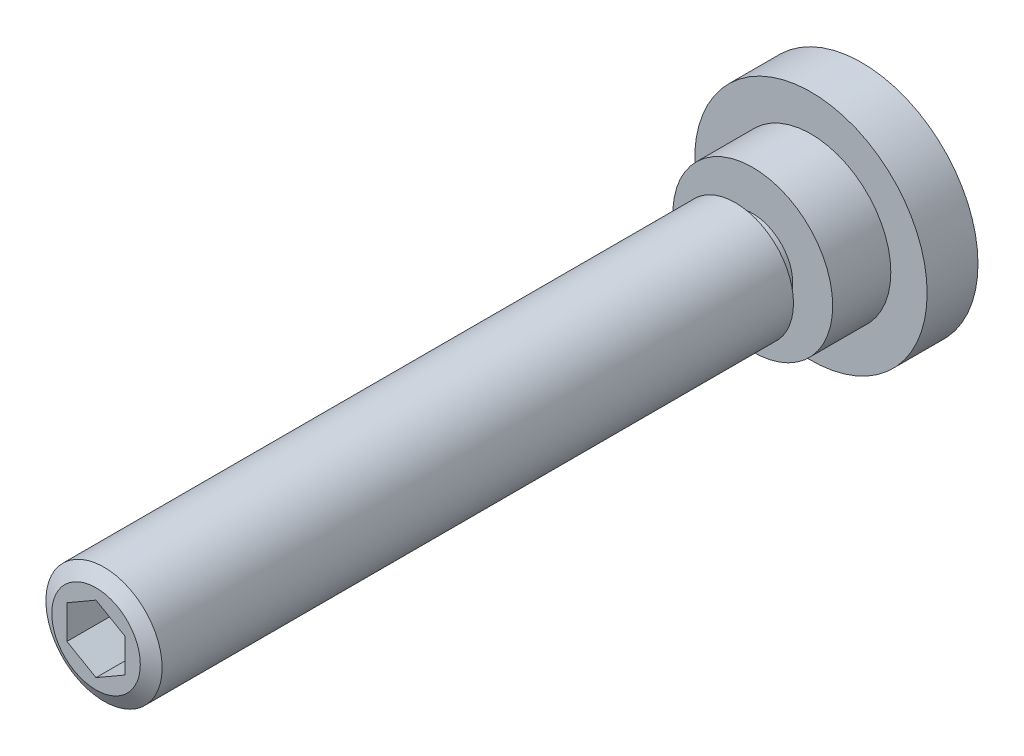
ISO-10303-21;
HEADER;
FILE_DESCRIPTION(('STEP AP214'),'2;1');
FILE_NAME('part.step','',(''),(''),'','','');
FILE_SCHEMA(('AUTOMOTIVE_DESIGN { 1 0 10303 214 1 1 1 1 }'));
ENDSEC;
DATA;
#1=APPLICATION_CONTEXT('core data for automotive mechanical design processes');
#2=APPLICATION_PROTOCOL_DEFINITION('international standard','automotive_design',2000,#1);
#3=PRODUCT_CONTEXT('',#1,'mechanical');
#4=PRODUCT('Part','Part','',(#3));
#5=PRODUCT_RELATED_PRODUCT_CATEGORY('part','',(#4));
#6=PRODUCT_DEFINITION_FORMATION('','',#4);
#7=PRODUCT_DEFINITION_CONTEXT('part definition',#1,'design');
#8=PRODUCT_DEFINITION('design','',#6,#7);
#9=PRODUCT_DEFINITION_SHAPE('','',#8);
#10=(LENGTH_UNIT() NAMED_UNIT(*) SI_UNIT(.MILLI.,.METRE.));
#11=(NAMED_UNIT(*) PLANE_ANGLE_UNIT() SI_UNIT($,.RADIAN.));
#12=(NAMED_UNIT(*) SI_UNIT($,.STERADIAN.) SOLID_ANGLE_UNIT());
#13=UNCERTAINTY_MEASURE_WITH_UNIT(LENGTH_MEASURE(1.E-05),#10,'distance_accuracy_value','');
#14=(GEOMETRIC_REPRESENTATION_CONTEXT(3) GLOBAL_UNCERTAINTY_ASSIGNED_CONTEXT((#13)) GLOBAL_UNIT_ASSIGNED_CONTEXT((#10,
#11,#12)) REPRESENTATION_CONTEXT('',''));
#15=CARTESIAN_POINT('',(0.,0.,0.));
#16=DIRECTION('',(0.,0.,1.));
#17=DIRECTION('',(1.,0.,0.));
#18=AXIS2_PLACEMENT_3D('',#15,#16,#17);
#19=CARTESIAN_POINT('',(-8.,0.,15.));
#20=DIRECTION('',(0.,0.,1.));
#21=DIRECTION('',(1.,0.,0.));
#22=AXIS2_PLACEMENT_3D('',#19,#20,#21);
#23=PLANE('',#22);
#24=CARTESIAN_POINT('',(0.,0.,15.));
#25=DIRECTION('',(0.,0.,1.));
#26=DIRECTION('',(1.,0.,0.));
#27=AXIS2_PLACEMENT_3D('',#24,#25,#26);
#28=CIRCLE('',#27,11.);
#29=CARTESIAN_POINT('',(11.,0.,15.));
#30=VERTEX_POINT('',#29);
#31=EDGE_CURVE('E131',#30,#30,#28,.T.);
#32=ORIENTED_EDGE('',*,*,#31,.T.);
#33=EDGE_LOOP('',(#32));
#34=FACE_BOUND('',#33,.T.);
#35=CARTESIAN_POINT('',(0.,0.,15.));
#36=DIRECTION('',(0.,0.,-1.));
#37=DIRECTION('',(-1.,0.,0.));
#38=AXIS2_PLACEMENT_3D('',#35,#36,#37);
#39=CIRCLE('',#38,5.5);
#40=CARTESIAN_POINT('',(-5.5,0.,15.));
#41=VERTEX_POINT('',#40);
#42=EDGE_CURVE('E314',#41,#41,#39,.T.);
#43=ORIENTED_EDGE('',*,*,#42,.T.);
#44=EDGE_LOOP('',(#43));
#45=FACE_BOUND('',#44,.T.);
#46=ADVANCED_FACE('F14',(#34,#45),#23,.T.);
#47=CARTESIAN_POINT('',(0.,0.,30.));
#48=DIRECTION('',(0.,0.,1.));
#49=DIRECTION('',(1.,0.,0.));
#50=AXIS2_PLACEMENT_3D('',#47,#48,#49);
#51=CYLINDRICAL_SURFACE('',#50,11.);
#52=CARTESIAN_POINT('',(0.,0.,7.));
#53=DIRECTION('',(0.,0.,1.));
#54=DIRECTION('',(1.,0.,0.));
#55=AXIS2_PLACEMENT_3D('',#52,#53,#54);
#56=CIRCLE('',#55,11.);
#57=CARTESIAN_POINT('',(11.,0.,7.));
#58=VERTEX_POINT('',#57);
#59=EDGE_CURVE('E128',#58,#58,#56,.T.);
#60=ORIENTED_EDGE('',*,*,#59,.T.);
#61=EDGE_LOOP('',(#60));
#62=FACE_BOUND('',#61,.T.);
#63=ORIENTED_EDGE('',*,*,#31,.F.);
#64=EDGE_LOOP('',(#63));
#65=FACE_BOUND('',#64,.T.);
#66=ADVANCED_FACE('F149',(#62,#65),#51,.T.);
#67=CARTESIAN_POINT('',(-11.,0.,7.));
#68=DIRECTION('',(0.,0.,1.));
#69=DIRECTION('',(1.,0.,0.));
#70=AXIS2_PLACEMENT_3D('',#67,#68,#69);
#71=PLANE('',#70);
#72=CARTESIAN_POINT('',(0.,0.,7.));
#73=DIRECTION('',(0.,0.,1.));
#74=DIRECTION('',(1.,0.,0.));
#75=AXIS2_PLACEMENT_3D('',#72,#73,#74);
#76=CIRCLE('',#75,16.);
#77=CARTESIAN_POINT('',(16.,0.,7.));
#78=VERTEX_POINT('',#77);
#79=EDGE_CURVE('E125',#78,#78,#76,.T.);
#80=ORIENTED_EDGE('',*,*,#79,.T.);
#81=EDGE_LOOP('',(#80));
#82=FACE_BOUND('',#81,.T.);
#83=ORIENTED_EDGE('',*,*,#59,.F.);
#84=EDGE_LOOP('',(#83));
#85=FACE_BOUND('',#84,.T.);
#86=ADVANCED_FACE('F156',(#82,#85),#71,.T.);
#87=CARTESIAN_POINT('',(0.,0.,30.));
#88=DIRECTION('',(0.,0.,1.));
#89=DIRECTION('',(1.,0.,0.));
#90=AXIS2_PLACEMENT_3D('',#87,#88,#89);
#91=CYLINDRICAL_SURFACE('',#90,16.);
#92=CARTESIAN_POINT('',(0.,0.,0.));
#93=DIRECTION('',(0.,0.,1.));
#94=DIRECTION('',(1.,0.,0.));
#95=AXIS2_PLACEMENT_3D('',#92,#93,#94);
#96=CIRCLE('',#95,16.);
#97=CARTESIAN_POINT('',(16.,0.,0.));
#98=VERTEX_POINT('',#97);
#99=EDGE_CURVE('E116',#98,#98,#96,.T.);
#100=ORIENTED_EDGE('',*,*,#99,.T.);
#101=EDGE_LOOP('',(#100));
#102=FACE_BOUND('',#101,.T.);
#103=ORIENTED_EDGE('',*,*,#79,.F.);
#104=EDGE_LOOP('',(#103));
#105=FACE_BOUND('',#104,.T.);
#106=ADVANCED_FACE('F182',(#102,#105),#91,.T.);
#107=CARTESIAN_POINT('',(-16.,0.,0.));
#108=DIRECTION('',(0.,0.,-1.));
#109=DIRECTION('',(-1.,0.,0.));
#110=AXIS2_PLACEMENT_3D('',#107,#108,#109);
#111=PLANE('',#110);
#112=ORIENTED_EDGE('',*,*,#99,.F.);
#113=EDGE_LOOP('',(#112));
#114=FACE_BOUND('',#113,.T.);
#115=ADVANCED_FACE('F178',(#114),#111,.T.);
#116=CARTESIAN_POINT('',(0.,0.,0.));
#117=DIRECTION('',(0.,0.,-1.));
#118=DIRECTION('',(-1.,0.,0.));
#119=AXIS2_PLACEMENT_3D('',#116,#117,#118);
#120=CYLINDRICAL_SURFACE('',#119,5.5);
#121=ORIENTED_EDGE('',*,*,#42,.F.);
#122=EDGE_LOOP('',(#121));
#123=FACE_BOUND('',#122,.T.);
#124=CARTESIAN_POINT('',(0.,0.,15.956624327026));
#125=DIRECTION('',(0.,0.,-1.));
#126=DIRECTION('',(-1.,0.,0.));
#127=AXIS2_PLACEMENT_3D('',#124,#125,#126);
#128=CIRCLE('',#127,5.5);
#129=CARTESIAN_POINT('',(-5.5,0.,15.956624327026));
#130=VERTEX_POINT('',#129);
#131=EDGE_CURVE('E316',#130,#130,#128,.T.);
#132=ORIENTED_EDGE('',*,*,#131,.T.);
#133=EDGE_LOOP('',(#132));
#134=FACE_BOUND('',#133,.T.);
#135=ADVANCED_FACE('F181',(#123,#134),#120,.T.);
#136=CARTESIAN_POINT('',(0.,0.,17.4));
#137=DIRECTION('',(0.,0.,1.));
#138=DIRECTION('',(1.,0.,0.));
#139=AXIS2_PLACEMENT_3D('',#136,#137,#138);
#140=CONICAL_SURFACE('',#139,8.,1.0471975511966);
#141=ORIENTED_EDGE('',*,*,#131,.F.);
#142=EDGE_LOOP('',(#141));
#143=FACE_BOUND('',#142,.T.);
#144=CARTESIAN_POINT('',(0.,0.,17.4));
#145=DIRECTION('',(0.,0.,-1.));
#146=DIRECTION('',(-1.,0.,0.));
#147=AXIS2_PLACEMENT_3D('',#144,#145,#146);
#148=CIRCLE('',#147,8.);
#149=CARTESIAN_POINT('',(-8.,0.,17.4));
#150=VERTEX_POINT('',#149);
#151=EDGE_CURVE('E321',#150,#150,#148,.T.);
#152=ORIENTED_EDGE('',*,*,#151,.T.);
#153=EDGE_LOOP('',(#152));
#154=FACE_BOUND('',#153,.T.);
#155=ADVANCED_FACE('F221',(#143,#154),#140,.T.);
#156=CARTESIAN_POINT('',(4.,2.30940107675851,99.4));
#157=DIRECTION('',(0.,0.,-1.));
#158=DIRECTION('',(-1.,0.,0.));
#159=AXIS2_PLACEMENT_3D('',#156,#157,#158);
#160=PLANE('',#159);
#161=DIRECTION('',(-0.866025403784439,0.5,0.));
#162=VECTOR('',#161,1.);
#163=CARTESIAN_POINT('',(4.,2.30940107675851,99.4));
#164=LINE('',#163,#162);
#165=CARTESIAN_POINT('',(4.,2.30940107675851,99.4));
#166=VERTEX_POINT('',#165);
#167=CARTESIAN_POINT('',(0.,4.618802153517,99.4));
#168=VERTEX_POINT('',#167);
#169=EDGE_CURVE('E100',#166,#168,#164,.T.);
#170=ORIENTED_EDGE('',*,*,#169,.T.);
#171=DIRECTION('',(-0.866025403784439,-0.5,0.));
#172=VECTOR('',#171,1.);
#173=CARTESIAN_POINT('',(0.,4.618802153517,99.4));
#174=LINE('',#173,#172);
#175=CARTESIAN_POINT('',(-4.,2.3094010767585,99.4));
#176=VERTEX_POINT('',#175);
#177=EDGE_CURVE('E103',#168,#176,#174,.T.);
#178=ORIENTED_EDGE('',*,*,#177,.T.);
#179=DIRECTION('',(0.,-1.,0.));
#180=VECTOR('',#179,1.);
#181=CARTESIAN_POINT('',(-4.,2.3094010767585,99.4));
#182=LINE('',#181,#180);
#183=CARTESIAN_POINT('',(-4.,-2.3094010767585,99.4));
#184=VERTEX_POINT('',#183);
#185=EDGE_CURVE('E75',#176,#184,#182,.T.);
#186=ORIENTED_EDGE('',*,*,#185,.T.);
#187=DIRECTION('',(0.866025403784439,-0.5,0.));
#188=VECTOR('',#187,1.);
#189=CARTESIAN_POINT('',(-4.,-2.3094010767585,99.4));
#190=LINE('',#189,#188);
#191=CARTESIAN_POINT('',(0.,-4.618802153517,99.4));
#192=VERTEX_POINT('',#191);
#193=EDGE_CURVE('E106',#184,#192,#190,.T.);
#194=ORIENTED_EDGE('',*,*,#193,.T.);
#195=DIRECTION('',(0.866025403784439,0.5,0.));
#196=VECTOR('',#195,1.);
#197=CARTESIAN_POINT('',(0.,-4.618802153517,99.4));
#198=LINE('',#197,#196);
#199=CARTESIAN_POINT('',(4.,-2.3094010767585,99.4));
#200=VERTEX_POINT('',#199);
#201=EDGE_CURVE('E109',#192,#200,#198,.T.);
#202=ORIENTED_EDGE('',*,*,#201,.T.);
#203=DIRECTION('',(0.,1.,0.));
#204=VECTOR('',#203,1.);
#205=CARTESIAN_POINT('',(4.,-2.3094010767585,99.4));
#206=LINE('',#205,#204);
#207=EDGE_CURVE('E112',#200,#166,#206,.T.);
#208=ORIENTED_EDGE('',*,*,#207,.T.);
#209=EDGE_LOOP('',(#170,#178,#186,#194,#202,#208));
#210=FACE_BOUND('',#209,.T.);
#211=ADVANCED_FACE('F230',(#210),#160,.F.);
#212=CARTESIAN_POINT('',(0.,4.618802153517,99.4));
#213=DIRECTION('',(-0.5,0.866025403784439,0.));
#214=DIRECTION('',(-0.866025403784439,-0.5,0.));
#215=AXIS2_PLACEMENT_3D('',#212,#213,#214);
#216=PLANE('',#215);
#217=DIRECTION('',(-0.866025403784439,-0.5,0.));
#218=VECTOR('',#217,1.);
#219=CARTESIAN_POINT('',(0.,4.618802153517,105.4));
#220=LINE('',#219,#218);
#221=CARTESIAN_POINT('',(0.,4.618802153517,105.4));
#222=VERTEX_POINT('',#221);
#223=CARTESIAN_POINT('',(-4.,2.3094010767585,105.4));
#224=VERTEX_POINT('',#223);
#225=EDGE_CURVE('E83',#222,#224,#220,.T.);
#226=ORIENTED_EDGE('',*,*,#225,.T.);
#227=DIRECTION('',(0.,0.,1.));
#228=VECTOR('',#227,1.);
#229=CARTESIAN_POINT('',(-4.,2.3094010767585,99.4));
#230=LINE('',#229,#228);
#231=EDGE_CURVE('E68',#176,#224,#230,.T.);
#232=ORIENTED_EDGE('',*,*,#231,.F.);
#233=ORIENTED_EDGE('',*,*,#177,.F.);
#234=DIRECTION('',(0.,0.,1.));
#235=VECTOR('',#234,1.);
#236=CARTESIAN_POINT('',(0.,4.618802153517,99.4));
#237=LINE('',#236,#235);
#238=EDGE_CURVE('E80',#168,#222,#237,.T.);
#239=ORIENTED_EDGE('',*,*,#238,.T.);
#240=EDGE_LOOP('',(#226,#232,#233,#239));
#241=FACE_BOUND('',#240,.T.);
#242=ADVANCED_FACE('F84',(#241),#216,.F.);
#243=CARTESIAN_POINT('',(-4.,2.3094010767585,99.4));
#244=DIRECTION('',(-1.,0.,0.));
#245=DIRECTION('',(0.,-1.,0.));
#246=AXIS2_PLACEMENT_3D('',#243,#244,#245);
#247=PLANE('',#246);
#248=DIRECTION('',(0.,-1.,0.));
#249=VECTOR('',#248,1.);
#250=CARTESIAN_POINT('',(-4.,2.3094010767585,105.4));
#251=LINE('',#250,#249);
#252=CARTESIAN_POINT('',(-4.,-2.3094010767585,105.4));
#253=VERTEX_POINT('',#252);
#254=EDGE_CURVE('E72',#224,#253,#251,.T.);
#255=ORIENTED_EDGE('',*,*,#254,.T.);
#256=DIRECTION('',(0.,0.,1.));
#257=VECTOR('',#256,1.);
#258=CARTESIAN_POINT('',(-4.,-2.3094010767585,99.4));
#259=LINE('',#258,#257);
#260=EDGE_CURVE('E79',#184,#253,#259,.T.);
#261=ORIENTED_EDGE('',*,*,#260,.F.);
#262=ORIENTED_EDGE('',*,*,#185,.F.);
#263=ORIENTED_EDGE('',*,*,#231,.T.);
#264=EDGE_LOOP('',(#255,#261,#262,#263));
#265=FACE_BOUND('',#264,.T.);
#266=ADVANCED_FACE('F70',(#265),#247,.F.);
#267=CARTESIAN_POINT('',(-4.,-2.3094010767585,99.4));
#268=DIRECTION('',(-0.5,-0.866025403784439,0.));
#269=DIRECTION('',(0.866025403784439,-0.5,0.));
#270=AXIS2_PLACEMENT_3D('',#267,#268,#269);
#271=PLANE('',#270);
#272=DIRECTION('',(0.866025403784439,-0.5,0.));
#273=VECTOR('',#272,1.);
#274=CARTESIAN_POINT('',(-4.,-2.3094010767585,105.4));
#275=LINE('',#274,#273);
#276=CARTESIAN_POINT('',(0.,-4.618802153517,105.4));
#277=VERTEX_POINT('',#276);
#278=EDGE_CURVE('E90',#253,#277,#275,.T.);
#279=ORIENTED_EDGE('',*,*,#278,.T.);
#280=DIRECTION('',(0.,0.,1.));
#281=VECTOR('',#280,1.);
#282=CARTESIAN_POINT('',(0.,-4.618802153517,99.4));
#283=LINE('',#282,#281);
#284=EDGE_CURVE('E119',#192,#277,#283,.T.);
#285=ORIENTED_EDGE('',*,*,#284,.F.);
#286=ORIENTED_EDGE('',*,*,#193,.F.);
#287=ORIENTED_EDGE('',*,*,#260,.T.);
#288=EDGE_LOOP('',(#279,#285,#286,#287));
#289=FACE_BOUND('',#288,.T.);
#290=ADVANCED_FACE('F253',(#289),#271,.F.);
#291=CARTESIAN_POINT('',(0.,-4.618802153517,99.4));
#292=DIRECTION('',(0.5,-0.866025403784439,0.));
#293=DIRECTION('',(0.866025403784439,0.5,0.));
#294=AXIS2_PLACEMENT_3D('',#291,#292,#293);
#295=PLANE('',#294);
#296=DIRECTION('',(0.866025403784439,0.5,0.));
#297=VECTOR('',#296,1.);
#298=CARTESIAN_POINT('',(0.,-4.618802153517,105.4));
#299=LINE('',#298,#297);
#300=CARTESIAN_POINT('',(4.,-2.3094010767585,105.4));
#301=VERTEX_POINT('',#300);
#302=EDGE_CURVE('E92',#277,#301,#299,.T.);
#303=ORIENTED_EDGE('',*,*,#302,.T.);
#304=DIRECTION('',(0.,0.,1.));
#305=VECTOR('',#304,1.);
#306=CARTESIAN_POINT('',(4.,-2.3094010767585,99.4));
#307=LINE('',#306,#305);
#308=EDGE_CURVE('E117',#200,#301,#307,.T.);
#309=ORIENTED_EDGE('',*,*,#308,.F.);
#310=ORIENTED_EDGE('',*,*,#201,.F.);
#311=ORIENTED_EDGE('',*,*,#284,.T.);
#312=EDGE_LOOP('',(#303,#309,#310,#311));
#313=FACE_BOUND('',#312,.T.);
#314=ADVANCED_FACE('F173',(#313),#295,.F.);
#315=CARTESIAN_POINT('',(4.,-2.3094010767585,99.4));
#316=DIRECTION('',(1.,0.,0.));
#317=DIRECTION('',(0.,0.,-1.));
#318=AXIS2_PLACEMENT_3D('',#315,#316,#317);
#319=PLANE('',#318);
#320=DIRECTION('',(0.,1.,0.));
#321=VECTOR('',#320,1.);
#322=CARTESIAN_POINT('',(4.,-2.3094010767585,105.4));
#323=LINE('',#322,#321);
#324=CARTESIAN_POINT('',(4.,2.30940107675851,105.4));
#325=VERTEX_POINT('',#324);
#326=EDGE_CURVE('E98',#301,#325,#323,.T.);
#327=ORIENTED_EDGE('',*,*,#326,.T.);
#328=DIRECTION('',(0.,0.,1.));
#329=VECTOR('',#328,1.);
#330=CARTESIAN_POINT('',(4.,2.30940107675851,99.4));
#331=LINE('',#330,#329);
#332=EDGE_CURVE('E36',#166,#325,#331,.T.);
#333=ORIENTED_EDGE('',*,*,#332,.F.);
#334=ORIENTED_EDGE('',*,*,#207,.F.);
#335=ORIENTED_EDGE('',*,*,#308,.T.);
#336=EDGE_LOOP('',(#327,#333,#334,#335));
#337=FACE_BOUND('',#336,.T.);
#338=ADVANCED_FACE('F167',(#337),#319,.F.);
#339=CARTESIAN_POINT('',(4.,2.30940107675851,99.4));
#340=DIRECTION('',(0.5,0.866025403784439,0.));
#341=DIRECTION('',(-0.866025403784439,0.5,0.));
#342=AXIS2_PLACEMENT_3D('',#339,#340,#341);
#343=PLANE('',#342);
#344=DIRECTION('',(-0.866025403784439,0.5,0.));
#345=VECTOR('',#344,1.);
#346=CARTESIAN_POINT('',(4.,2.30940107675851,105.4));
#347=LINE('',#346,#345);
#348=EDGE_CURVE('E29',#325,#222,#347,.T.);
#349=ORIENTED_EDGE('',*,*,#348,.T.);
#350=ORIENTED_EDGE('',*,*,#238,.F.);
#351=ORIENTED_EDGE('',*,*,#169,.F.);
#352=ORIENTED_EDGE('',*,*,#332,.T.);
#353=EDGE_LOOP('',(#349,#350,#351,#352));
#354=FACE_BOUND('',#353,.T.);
#355=ADVANCED_FACE('F162',(#354),#343,.F.);
#356=CARTESIAN_POINT('',(0.,0.,105.4));
#357=DIRECTION('',(0.,0.,1.));
#358=DIRECTION('',(1.,0.,0.));
#359=AXIS2_PLACEMENT_3D('',#356,#357,#358);
#360=PLANE('',#359);
#361=CARTESIAN_POINT('',(0.,0.,105.4));
#362=DIRECTION('',(0.,0.,1.));
#363=DIRECTION('',(1.,0.,0.));
#364=AXIS2_PLACEMENT_3D('',#361,#362,#363);
#365=CIRCLE('',#364,6.09474411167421);
#366=CARTESIAN_POINT('',(6.09474411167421,0.,105.4));
#367=VERTEX_POINT('',#366);
#368=EDGE_CURVE('E22',#367,#367,#365,.T.);
#369=ORIENTED_EDGE('',*,*,#368,.T.);
#370=EDGE_LOOP('',(#369));
#371=FACE_BOUND('',#370,.T.);
#372=ORIENTED_EDGE('',*,*,#348,.F.);
#373=ORIENTED_EDGE('',*,*,#326,.F.);
#374=ORIENTED_EDGE('',*,*,#302,.F.);
#375=ORIENTED_EDGE('',*,*,#278,.F.);
#376=ORIENTED_EDGE('',*,*,#254,.F.);
#377=ORIENTED_EDGE('',*,*,#225,.F.);
#378=EDGE_LOOP('',(#372,#373,#374,#375,#376,#377));
#379=FACE_BOUND('',#378,.T.);
#380=ADVANCED_FACE('F87',(#371,#379),#360,.T.);
#381=CARTESIAN_POINT('',(0.,0.,30.));
#382=DIRECTION('',(0.,0.,1.));
#383=DIRECTION('',(1.,0.,0.));
#384=AXIS2_PLACEMENT_3D('',#381,#382,#383);
#385=CYLINDRICAL_SURFACE('',#384,8.);
#386=CARTESIAN_POINT('',(0.,0.,104.3));
#387=DIRECTION('',(0.,0.,1.));
#388=DIRECTION('',(1.,0.,0.));
#389=AXIS2_PLACEMENT_3D('',#386,#387,#388);
#390=CIRCLE('',#389,8.);
#391=CARTESIAN_POINT('',(8.,0.,104.3));
#392=VERTEX_POINT('',#391);
#393=EDGE_CURVE('E9',#392,#392,#390,.F.);
#394=ORIENTED_EDGE('',*,*,#393,.T.);
#395=EDGE_LOOP('',(#394));
#396=FACE_BOUND('',#395,.T.);
#397=ORIENTED_EDGE('',*,*,#151,.F.);
#398=EDGE_LOOP('',(#397));
#399=FACE_BOUND('',#398,.T.);
#400=ADVANCED_FACE('F138',(#396,#399),#385,.T.);
#401=CARTESIAN_POINT('',(0.,0.,105.4));
#402=DIRECTION('',(0.,0.,-1.));
#403=DIRECTION('',(-1.,0.,0.));
#404=AXIS2_PLACEMENT_3D('',#401,#402,#403);
#405=CONICAL_SURFACE('',#404,6.09474411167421,1.0471975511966);
#406=ORIENTED_EDGE('',*,*,#393,.F.);
#407=EDGE_LOOP('',(#406));
#408=FACE_BOUND('',#407,.T.);
#409=ORIENTED_EDGE('',*,*,#368,.F.);
#410=EDGE_LOOP('',(#409));
#411=FACE_BOUND('',#410,.T.);
#412=ADVANCED_FACE('F16',(#408,#411),#405,.T.);
#413=CLOSED_SHELL('',(#46,#66,#86,#106,#115,#135,#155,#211,#242,#266,#290,#314,#338,#355,#380,
#400,#412));
#414=MANIFOLD_SOLID_BREP('B1',#413);
#415=ADVANCED_BREP_SHAPE_REPRESENTATION('',(#18,#414),#14);
#416=SHAPE_DEFINITION_REPRESENTATION(#9,#415);
ENDSEC;
END-ISO-10303-21;
